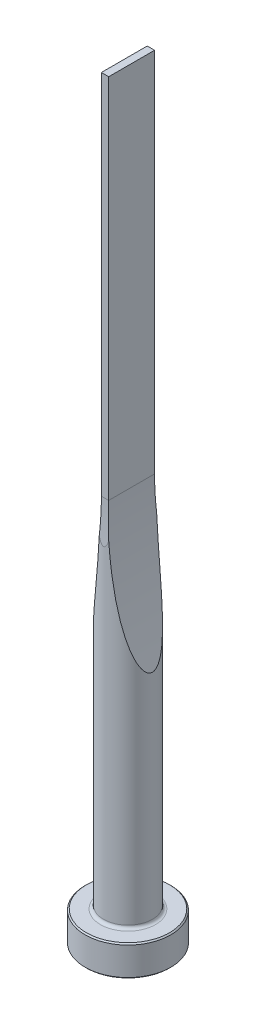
from build123d import *

# Parameters (mm, degrees)
CUT_EXTRUDE1_DEPTH = 5
CUT_EXTRUDE2_DEPTH = 5


with BuildPart() as part:
    # Sketch1 → Revolve1 (revolve)
    with BuildSketch(Plane.XY, mode=Mode.PRIVATE) as revolve1_sk:
        with BuildLine():
            Line((0, 0), (6.8, 0))
            Line((6.8, 0), (7, 0.2))
            Line((7, 0.2), (7, 4.8))
            Line((7, 4.8), (6.8, 5))
            Line((6.8, 5), (4.5, 5))
            ThreePointArc((4.5, 5), (4.146446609, 5.146446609), (4, 5.5))
            Line((4, 5.5), (4, 125))
            Line((4, 125), (0, 125))
            Line((0, 125), (0, 0))
        make_face()
    revolve(revolve1_sk.sketch.rotate(Axis((0, 125, 0), (0, -1, 0)), 180), axis=Axis((0, 125, 0), (0, -1, 0)))

    # Sketch2 → Cut-Extrude1 (cut, symmetric)
    with BuildSketch(Plane.XY):
        with BuildLine():
            Line((0.6, 125), (0.6, 65))
            ThreePointArc((0.6, 65), (1.454052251, 52.630683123), (4, 40.496122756))
            Line((4, 40.496122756), (4, 125))
            Line((4, 125), (0.6, 125))
        make_face()
        with BuildLine():
            Line((-0.6, 125), (-0.6, 65))
            ThreePointArc((-0.6, 65), (-1.454052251, 52.630683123), (-4, 40.496122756))
            Line((-4, 40.496122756), (-4, 125))
            Line((-4, 125), (-0.6, 125))
        make_face()
    extrude(amount=CUT_EXTRUDE1_DEPTH, both=True, mode=Mode.SUBTRACT)

    # Sketch3 → Cut-Extrude2 (cut, symmetric)
    with BuildSketch(Plane(origin=(0, 0, 0), x_dir=(0, 0, -1), z_dir=(1, 0, 0))):
        with BuildLine():
            Line((3.75, 125), (3.75, 65))
            ThreePointArc((3.75, 65), (3.812521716, 61.645898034), (4, 58.296456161))
            Line((4, 58.296456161), (4, 125))
            Line((4, 125), (3.75, 125))
        make_face()
        with BuildLine():
            Line((-3.75, 125), (-3.75, 65))
            ThreePointArc((-3.75, 65), (-3.812521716, 61.645898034), (-4, 58.296456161))
            Line((-4, 58.296456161), (-4, 125))
            Line((-4, 125), (-3.75, 125))
        make_face()
    extrude(amount=CUT_EXTRUDE2_DEPTH, both=True, mode=Mode.SUBTRACT)


solid = part.part
